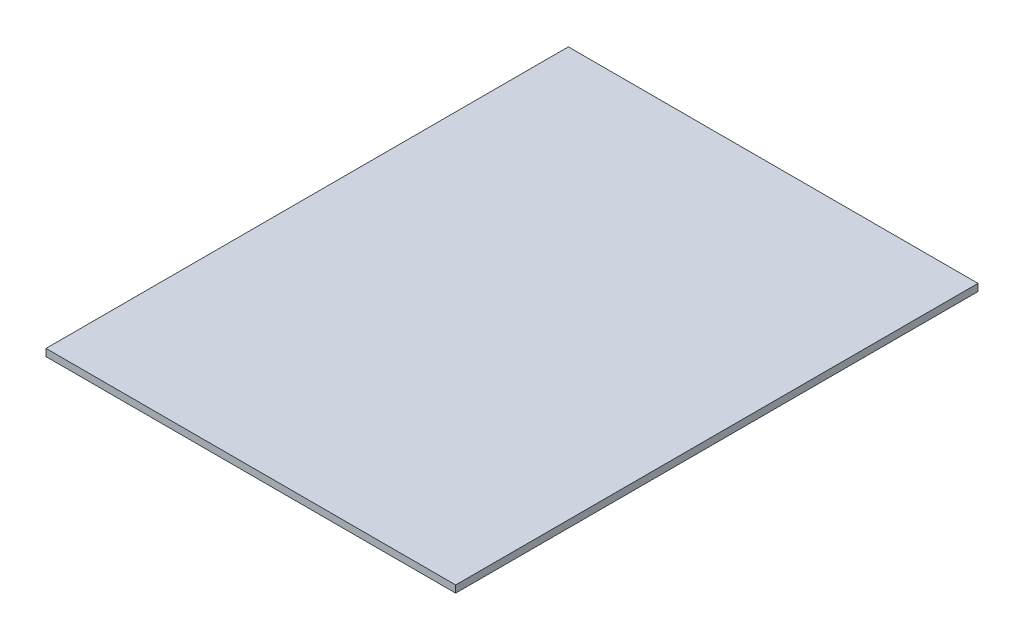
from build123d import *

# Parameters (mm, degrees)
SKETCH1_W      = 146.018315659
SKETCH1_H      = 186.172895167
EXTRUDE1_DEPTH = 2.54


with BuildPart() as part:
    # Sketch1 → Extrude1 (new body)
    with BuildSketch(Plane(origin=(0, 0, 0), x_dir=(1, 0, 0), z_dir=(0, 1, 0))):
        with Locations((73.009157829, 93.086447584)):
            Rectangle(SKETCH1_W, SKETCH1_H)
    extrude(amount=EXTRUDE1_DEPTH)


solid = part.part
